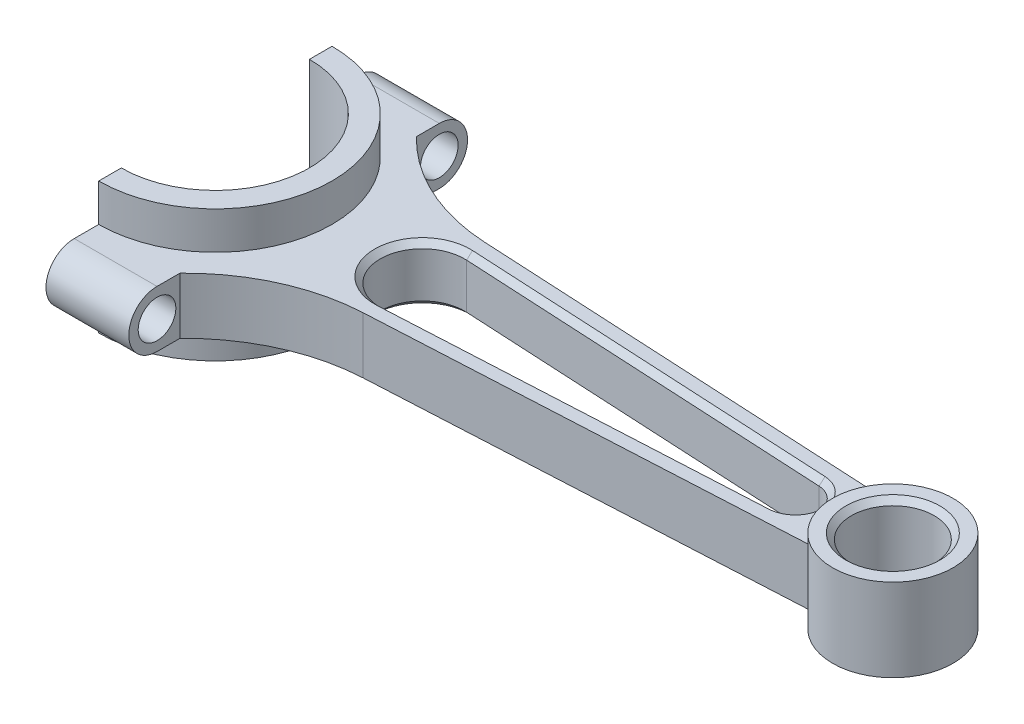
ISO-10303-21;
HEADER;
FILE_DESCRIPTION(('STEP AP214'),'2;1');
FILE_NAME('part.step','',(''),(''),'','','');
FILE_SCHEMA(('AUTOMOTIVE_DESIGN { 1 0 10303 214 1 1 1 1 }'));
ENDSEC;
DATA;
#1=APPLICATION_CONTEXT('core data for automotive mechanical design processes');
#2=APPLICATION_PROTOCOL_DEFINITION('international standard','automotive_design',2000,#1);
#3=PRODUCT_CONTEXT('',#1,'mechanical');
#4=PRODUCT('Part','Part','',(#3));
#5=PRODUCT_RELATED_PRODUCT_CATEGORY('part','',(#4));
#6=PRODUCT_DEFINITION_FORMATION('','',#4);
#7=PRODUCT_DEFINITION_CONTEXT('part definition',#1,'design');
#8=PRODUCT_DEFINITION('design','',#6,#7);
#9=PRODUCT_DEFINITION_SHAPE('','',#8);
#10=(LENGTH_UNIT() NAMED_UNIT(*) SI_UNIT(.MILLI.,.METRE.));
#11=(NAMED_UNIT(*) PLANE_ANGLE_UNIT() SI_UNIT($,.RADIAN.));
#12=(NAMED_UNIT(*) SI_UNIT($,.STERADIAN.) SOLID_ANGLE_UNIT());
#13=UNCERTAINTY_MEASURE_WITH_UNIT(LENGTH_MEASURE(1.E-05),#10,'distance_accuracy_value','');
#14=(GEOMETRIC_REPRESENTATION_CONTEXT(3) GLOBAL_UNCERTAINTY_ASSIGNED_CONTEXT((#13)) GLOBAL_UNIT_ASSIGNED_CONTEXT((#10,
#11,#12)) REPRESENTATION_CONTEXT('',''));
#15=CARTESIAN_POINT('',(0.,0.,0.));
#16=DIRECTION('',(0.,0.,1.));
#17=DIRECTION('',(1.,0.,0.));
#18=AXIS2_PLACEMENT_3D('',#15,#16,#17);
#19=CARTESIAN_POINT('',(22.,0.,-37.5));
#20=DIRECTION('',(1.,0.,0.));
#21=DIRECTION('',(0.,0.,-1.));
#22=AXIS2_PLACEMENT_3D('',#19,#20,#21);
#23=CYLINDRICAL_SURFACE('',#22,7.5);
#24=DIRECTION('',(1.,0.,0.));
#25=VECTOR('',#24,1.);
#26=CARTESIAN_POINT('',(0.,7.5,-37.5));
#27=LINE('',#26,#25);
#28=CARTESIAN_POINT('',(22.,7.5,-37.5));
#29=VERTEX_POINT('',#28);
#30=CARTESIAN_POINT('',(0.,7.5,-37.5));
#31=VERTEX_POINT('',#30);
#32=EDGE_CURVE('E344',#29,#31,#27,.F.);
#33=ORIENTED_EDGE('',*,*,#32,.F.);
#34=CARTESIAN_POINT('',(22.,0.,-37.5));
#35=DIRECTION('',(1.,0.,0.));
#36=DIRECTION('',(0.,0.,-1.));
#37=AXIS2_PLACEMENT_3D('',#34,#35,#36);
#38=CIRCLE('',#37,7.5);
#39=CARTESIAN_POINT('',(22.,-7.5,-37.5));
#40=VERTEX_POINT('',#39);
#41=EDGE_CURVE('E350',#40,#29,#38,.T.);
#42=ORIENTED_EDGE('',*,*,#41,.F.);
#43=DIRECTION('',(-1.,0.,0.));
#44=VECTOR('',#43,1.);
#45=CARTESIAN_POINT('',(22.,-7.5,-37.5));
#46=LINE('',#45,#44);
#47=CARTESIAN_POINT('',(0.,-7.5,-37.5));
#48=VERTEX_POINT('',#47);
#49=EDGE_CURVE('E347',#48,#40,#46,.F.);
#50=ORIENTED_EDGE('',*,*,#49,.F.);
#51=CARTESIAN_POINT('',(0.,0.,-37.5));
#52=DIRECTION('',(-1.,0.,0.));
#53=DIRECTION('',(0.,0.,1.));
#54=AXIS2_PLACEMENT_3D('',#51,#52,#53);
#55=CIRCLE('',#54,7.5);
#56=EDGE_CURVE('E352',#31,#48,#55,.T.);
#57=ORIENTED_EDGE('',*,*,#56,.F.);
#58=EDGE_LOOP('',(#33,#42,#50,#57));
#59=FACE_BOUND('',#58,.T.);
#60=ADVANCED_FACE('F34',(#59),#23,.T.);
#61=CARTESIAN_POINT('',(0.,0.,37.5));
#62=DIRECTION('',(1.,0.,0.));
#63=DIRECTION('',(0.,0.,-1.));
#64=AXIS2_PLACEMENT_3D('',#61,#62,#63);
#65=CYLINDRICAL_SURFACE('',#64,7.5);
#66=DIRECTION('',(-1.,0.,0.));
#67=VECTOR('',#66,1.);
#68=CARTESIAN_POINT('',(0.,7.5,37.5));
#69=LINE('',#68,#67);
#70=CARTESIAN_POINT('',(0.,7.5,37.5));
#71=VERTEX_POINT('',#70);
#72=CARTESIAN_POINT('',(22.,7.5,37.5));
#73=VERTEX_POINT('',#72);
#74=EDGE_CURVE('E324',#71,#73,#69,.F.);
#75=ORIENTED_EDGE('',*,*,#74,.F.);
#76=CARTESIAN_POINT('',(0.,0.,37.5));
#77=DIRECTION('',(-1.,0.,0.));
#78=DIRECTION('',(0.,0.,1.));
#79=AXIS2_PLACEMENT_3D('',#76,#77,#78);
#80=CIRCLE('',#79,7.5);
#81=CARTESIAN_POINT('',(0.,-7.5,37.5));
#82=VERTEX_POINT('',#81);
#83=EDGE_CURVE('E340',#82,#71,#80,.T.);
#84=ORIENTED_EDGE('',*,*,#83,.F.);
#85=DIRECTION('',(1.,0.,0.));
#86=VECTOR('',#85,1.);
#87=CARTESIAN_POINT('',(0.,-7.5,37.5));
#88=LINE('',#87,#86);
#89=CARTESIAN_POINT('',(22.,-7.5,37.5));
#90=VERTEX_POINT('',#89);
#91=EDGE_CURVE('E337',#90,#82,#88,.F.);
#92=ORIENTED_EDGE('',*,*,#91,.F.);
#93=CARTESIAN_POINT('',(22.,0.,37.5));
#94=DIRECTION('',(-1.,0.,0.));
#95=DIRECTION('',(0.,0.,1.));
#96=AXIS2_PLACEMENT_3D('',#93,#94,#95);
#97=CIRCLE('',#96,7.5);
#98=EDGE_CURVE('E342',#73,#90,#97,.F.);
#99=ORIENTED_EDGE('',*,*,#98,.F.);
#100=EDGE_LOOP('',(#75,#84,#92,#99));
#101=FACE_BOUND('',#100,.T.);
#102=ADVANCED_FACE('F469',(#101),#65,.T.);
#103=CARTESIAN_POINT('',(0.,7.5,0.));
#104=DIRECTION('',(-1.,0.,0.));
#105=DIRECTION('',(0.,0.,1.));
#106=AXIS2_PLACEMENT_3D('',#103,#104,#105);
#107=PLANE('',#106);
#108=CARTESIAN_POINT('',(0.,0.,-37.5));
#109=DIRECTION('',(1.,0.,0.));
#110=DIRECTION('',(0.,0.,-1.));
#111=AXIS2_PLACEMENT_3D('',#108,#109,#110);
#112=CIRCLE('',#111,5.00000000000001);
#113=CARTESIAN_POINT('',(0.,0.,-42.5));
#114=VERTEX_POINT('',#113);
#115=EDGE_CURVE('E627',#114,#114,#112,.T.);
#116=ORIENTED_EDGE('',*,*,#115,.T.);
#117=EDGE_LOOP('',(#116));
#118=FACE_BOUND('',#117,.T.);
#119=DIRECTION('',(0.,0.,-1.));
#120=VECTOR('',#119,1.);
#121=CARTESIAN_POINT('',(0.,7.5,0.));
#122=LINE('',#121,#120);
#123=CARTESIAN_POINT('',(0.,7.5,-31.));
#124=VERTEX_POINT('',#123);
#125=EDGE_CURVE('E254',#124,#31,#122,.T.);
#126=ORIENTED_EDGE('',*,*,#125,.T.);
#127=ORIENTED_EDGE('',*,*,#56,.T.);
#128=DIRECTION('',(0.,0.,-1.));
#129=VECTOR('',#128,1.);
#130=CARTESIAN_POINT('',(0.,-7.5,0.));
#131=LINE('',#130,#129);
#132=CARTESIAN_POINT('',(0.,-7.5,-31.));
#133=VERTEX_POINT('',#132);
#134=EDGE_CURVE('E251',#133,#48,#131,.T.);
#135=ORIENTED_EDGE('',*,*,#134,.F.);
#136=DIRECTION('',(0.,-1.,0.));
#137=VECTOR('',#136,1.);
#138=CARTESIAN_POINT('',(0.,17.5,-31.));
#139=LINE('',#138,#137);
#140=CARTESIAN_POINT('',(0.,-17.5,-31.));
#141=VERTEX_POINT('',#140);
#142=EDGE_CURVE('E242',#133,#141,#139,.T.);
#143=ORIENTED_EDGE('',*,*,#142,.T.);
#144=DIRECTION('',(0.,0.,-1.));
#145=VECTOR('',#144,1.);
#146=CARTESIAN_POINT('',(0.,-17.5,0.));
#147=LINE('',#146,#145);
#148=CARTESIAN_POINT('',(0.,-17.5,-25.));
#149=VERTEX_POINT('',#148);
#150=EDGE_CURVE('E209',#149,#141,#147,.T.);
#151=ORIENTED_EDGE('',*,*,#150,.F.);
#152=DIRECTION('',(0.,-1.,0.));
#153=VECTOR('',#152,1.);
#154=CARTESIAN_POINT('',(0.,17.5,-25.));
#155=LINE('',#154,#153);
#156=CARTESIAN_POINT('',(0.,17.5,-25.));
#157=VERTEX_POINT('',#156);
#158=EDGE_CURVE('E231',#157,#149,#155,.T.);
#159=ORIENTED_EDGE('',*,*,#158,.F.);
#160=DIRECTION('',(0.,0.,-1.));
#161=VECTOR('',#160,1.);
#162=CARTESIAN_POINT('',(0.,17.5,0.));
#163=LINE('',#162,#161);
#164=CARTESIAN_POINT('',(0.,17.5,-31.));
#165=VERTEX_POINT('',#164);
#166=EDGE_CURVE('E207',#157,#165,#163,.T.);
#167=ORIENTED_EDGE('',*,*,#166,.T.);
#168=EDGE_CURVE('E243',#165,#124,#139,.T.);
#169=ORIENTED_EDGE('',*,*,#168,.T.);
#170=EDGE_LOOP('',(#126,#127,#135,#143,#151,#159,#167,#169));
#171=FACE_BOUND('',#170,.T.);
#172=ADVANCED_FACE('F475',(#118,#171),#107,.T.);
#173=CARTESIAN_POINT('',(0.,7.5,0.));
#174=DIRECTION('',(-1.,0.,0.));
#175=DIRECTION('',(0.,0.,1.));
#176=AXIS2_PLACEMENT_3D('',#173,#174,#175);
#177=PLANE('',#176);
#178=CARTESIAN_POINT('',(0.,0.,37.5));
#179=DIRECTION('',(1.,0.,0.));
#180=DIRECTION('',(0.,0.,-1.));
#181=AXIS2_PLACEMENT_3D('',#178,#179,#180);
#182=CIRCLE('',#181,5.00000000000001);
#183=CARTESIAN_POINT('',(0.,0.,32.5));
#184=VERTEX_POINT('',#183);
#185=EDGE_CURVE('E234',#184,#184,#182,.T.);
#186=ORIENTED_EDGE('',*,*,#185,.T.);
#187=EDGE_LOOP('',(#186));
#188=FACE_BOUND('',#187,.T.);
#189=DIRECTION('',(0.,0.,-1.));
#190=VECTOR('',#189,1.);
#191=CARTESIAN_POINT('',(0.,-7.5,0.));
#192=LINE('',#191,#190);
#193=CARTESIAN_POINT('',(0.,-7.5,31.));
#194=VERTEX_POINT('',#193);
#195=EDGE_CURVE('E287',#82,#194,#192,.T.);
#196=ORIENTED_EDGE('',*,*,#195,.F.);
#197=ORIENTED_EDGE('',*,*,#83,.T.);
#198=DIRECTION('',(0.,0.,-1.));
#199=VECTOR('',#198,1.);
#200=CARTESIAN_POINT('',(0.,7.5,0.));
#201=LINE('',#200,#199);
#202=CARTESIAN_POINT('',(0.,7.5,31.));
#203=VERTEX_POINT('',#202);
#204=EDGE_CURVE('E261',#71,#203,#201,.T.);
#205=ORIENTED_EDGE('',*,*,#204,.T.);
#206=DIRECTION('',(0.,-1.,0.));
#207=VECTOR('',#206,1.);
#208=CARTESIAN_POINT('',(0.,17.5,31.));
#209=LINE('',#208,#207);
#210=CARTESIAN_POINT('',(0.,17.5,31.));
#211=VERTEX_POINT('',#210);
#212=EDGE_CURVE('E220',#211,#203,#209,.T.);
#213=ORIENTED_EDGE('',*,*,#212,.F.);
#214=DIRECTION('',(0.,0.,-1.));
#215=VECTOR('',#214,1.);
#216=CARTESIAN_POINT('',(0.,17.5,0.));
#217=LINE('',#216,#215);
#218=CARTESIAN_POINT('',(0.,17.5,25.));
#219=VERTEX_POINT('',#218);
#220=EDGE_CURVE('E204',#211,#219,#217,.T.);
#221=ORIENTED_EDGE('',*,*,#220,.T.);
#222=DIRECTION('',(0.,-1.,0.));
#223=VECTOR('',#222,1.);
#224=CARTESIAN_POINT('',(0.,17.5,25.));
#225=LINE('',#224,#223);
#226=CARTESIAN_POINT('',(0.,-17.5,25.));
#227=VERTEX_POINT('',#226);
#228=EDGE_CURVE('E212',#219,#227,#225,.T.);
#229=ORIENTED_EDGE('',*,*,#228,.T.);
#230=DIRECTION('',(0.,0.,-1.));
#231=VECTOR('',#230,1.);
#232=CARTESIAN_POINT('',(0.,-17.5,0.));
#233=LINE('',#232,#231);
#234=CARTESIAN_POINT('',(0.,-17.5,31.));
#235=VERTEX_POINT('',#234);
#236=EDGE_CURVE('E233',#235,#227,#233,.T.);
#237=ORIENTED_EDGE('',*,*,#236,.F.);
#238=EDGE_CURVE('E246',#194,#235,#209,.T.);
#239=ORIENTED_EDGE('',*,*,#238,.F.);
#240=EDGE_LOOP('',(#196,#197,#205,#213,#221,#229,#237,#239));
#241=FACE_BOUND('',#240,.T.);
#242=ADVANCED_FACE('F223',(#188,#241),#177,.T.);
#243=CARTESIAN_POINT('',(22.,7.5,0.));
#244=DIRECTION('',(-1.,0.,0.));
#245=DIRECTION('',(0.,0.,1.));
#246=AXIS2_PLACEMENT_3D('',#243,#244,#245);
#247=PLANE('',#246);
#248=CARTESIAN_POINT('',(22.,0.,37.5));
#249=DIRECTION('',(1.,0.,0.));
#250=DIRECTION('',(0.,0.,-1.));
#251=AXIS2_PLACEMENT_3D('',#248,#249,#250);
#252=CIRCLE('',#251,5.00000000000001);
#253=CARTESIAN_POINT('',(22.,0.,32.5));
#254=VERTEX_POINT('',#253);
#255=EDGE_CURVE('E630',#254,#254,#252,.T.);
#256=ORIENTED_EDGE('',*,*,#255,.F.);
#257=EDGE_LOOP('',(#256));
#258=FACE_BOUND('',#257,.T.);
#259=DIRECTION('',(0.,0.,-1.));
#260=VECTOR('',#259,1.);
#261=CARTESIAN_POINT('',(22.,7.5,0.));
#262=LINE('',#261,#260);
#263=CARTESIAN_POINT('',(22.,7.5,31.421296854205));
#264=VERTEX_POINT('',#263);
#265=EDGE_CURVE('E263',#73,#264,#262,.T.);
#266=ORIENTED_EDGE('',*,*,#265,.F.);
#267=ORIENTED_EDGE('',*,*,#98,.T.);
#268=DIRECTION('',(0.,0.,-1.));
#269=VECTOR('',#268,1.);
#270=CARTESIAN_POINT('',(22.,-7.5,0.));
#271=LINE('',#270,#269);
#272=CARTESIAN_POINT('',(22.,-7.5,31.421296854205));
#273=VERTEX_POINT('',#272);
#274=EDGE_CURVE('E289',#90,#273,#271,.T.);
#275=ORIENTED_EDGE('',*,*,#274,.T.);
#276=DIRECTION('',(0.,-1.,0.));
#277=VECTOR('',#276,1.);
#278=CARTESIAN_POINT('',(22.,7.5,31.421296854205));
#279=LINE('',#278,#277);
#280=EDGE_CURVE('E321',#264,#273,#279,.T.);
#281=ORIENTED_EDGE('',*,*,#280,.F.);
#282=EDGE_LOOP('',(#266,#267,#275,#281));
#283=FACE_BOUND('',#282,.T.);
#284=ADVANCED_FACE('F544',(#258,#283),#247,.F.);
#285=CARTESIAN_POINT('',(58.,7.5,66.12));
#286=DIRECTION('',(0.,-1.,0.));
#287=DIRECTION('',(0.,0.,-1.));
#288=AXIS2_PLACEMENT_3D('',#285,#286,#287);
#289=CYLINDRICAL_SURFACE('',#288,50.);
#290=CARTESIAN_POINT('',(58.,-7.5,66.12));
#291=DIRECTION('',(0.,1.,0.));
#292=DIRECTION('',(0.,0.,1.));
#293=AXIS2_PLACEMENT_3D('',#290,#291,#292);
#294=CIRCLE('',#293,50.);
#295=CARTESIAN_POINT('',(55.3832021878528,-7.5,16.1885232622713));
#296=VERTEX_POINT('',#295);
#297=EDGE_CURVE('E291',#273,#296,#294,.F.);
#298=ORIENTED_EDGE('',*,*,#297,.T.);
#299=DIRECTION('',(0.,-1.,0.));
#300=VECTOR('',#299,1.);
#301=CARTESIAN_POINT('',(55.3832021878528,7.5,16.1885232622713));
#302=LINE('',#301,#300);
#303=CARTESIAN_POINT('',(55.3832021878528,7.5,16.1885232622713));
#304=VERTEX_POINT('',#303);
#305=EDGE_CURVE('E318',#304,#296,#302,.T.);
#306=ORIENTED_EDGE('',*,*,#305,.F.);
#307=CARTESIAN_POINT('',(58.,7.5,66.12));
#308=DIRECTION('',(0.,1.,0.));
#309=DIRECTION('',(0.,0.,1.));
#310=AXIS2_PLACEMENT_3D('',#307,#308,#309);
#311=CIRCLE('',#310,50.);
#312=EDGE_CURVE('E265',#264,#304,#311,.F.);
#313=ORIENTED_EDGE('',*,*,#312,.F.);
#314=ORIENTED_EDGE('',*,*,#280,.T.);
#315=EDGE_LOOP('',(#298,#306,#313,#314));
#316=FACE_BOUND('',#315,.T.);
#317=ADVANCED_FACE('F546',(#316),#289,.F.);
#318=CARTESIAN_POINT('',(0.997778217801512,7.5,19.0387425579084));
#319=DIRECTION('',(-0.0523359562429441,0.,-0.998629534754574));
#320=DIRECTION('',(-0.998629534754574,0.,0.0523359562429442));
#321=AXIS2_PLACEMENT_3D('',#318,#319,#320);
#322=PLANE('',#321);
#323=DIRECTION('',(0.998629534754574,0.,-0.0523359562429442));
#324=VECTOR('',#323,1.);
#325=CARTESIAN_POINT('',(0.997778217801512,-7.5,19.0387425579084));
#326=LINE('',#325,#324);
#327=CARTESIAN_POINT('',(167.75566421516,-7.5,10.2993320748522));
#328=VERTEX_POINT('',#327);
#329=EDGE_CURVE('E294',#296,#328,#326,.T.);
#330=ORIENTED_EDGE('',*,*,#329,.T.);
#331=DIRECTION('',(0.,-1.,0.));
#332=VECTOR('',#331,1.);
#333=CARTESIAN_POINT('',(167.75566421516,7.5,10.2993320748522));
#334=LINE('',#333,#332);
#335=CARTESIAN_POINT('',(167.75566421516,7.5,10.2993320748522));
#336=VERTEX_POINT('',#335);
#337=EDGE_CURVE('E316',#336,#328,#334,.T.);
#338=ORIENTED_EDGE('',*,*,#337,.F.);
#339=DIRECTION('',(0.998629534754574,0.,-0.0523359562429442));
#340=VECTOR('',#339,1.);
#341=CARTESIAN_POINT('',(0.997778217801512,7.5,19.0387425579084));
#342=LINE('',#341,#340);
#343=EDGE_CURVE('E268',#304,#336,#342,.T.);
#344=ORIENTED_EDGE('',*,*,#343,.F.);
#345=ORIENTED_EDGE('',*,*,#305,.T.);
#346=EDGE_LOOP('',(#330,#338,#344,#345));
#347=FACE_BOUND('',#346,.T.);
#348=ADVANCED_FACE('F551',(#347),#322,.F.);
#349=CARTESIAN_POINT('',(0.997778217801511,7.5,-19.0387425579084));
#350=DIRECTION('',(0.052335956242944,0.,-0.998629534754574));
#351=DIRECTION('',(-0.998629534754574,0.,-0.052335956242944));
#352=AXIS2_PLACEMENT_3D('',#349,#350,#351);
#353=PLANE('',#352);
#354=DIRECTION('',(0.998629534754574,0.,0.052335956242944));
#355=VECTOR('',#354,1.);
#356=CARTESIAN_POINT('',(0.997778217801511,-7.5,-19.0387425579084));
#357=LINE('',#356,#355);
#358=CARTESIAN_POINT('',(55.3832021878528,-7.5,-16.1885232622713));
#359=VERTEX_POINT('',#358);
#360=CARTESIAN_POINT('',(167.75566421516,-7.5,-10.2993320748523));
#361=VERTEX_POINT('',#360);
#362=EDGE_CURVE('E300',#359,#361,#357,.T.);
#363=ORIENTED_EDGE('',*,*,#362,.F.);
#364=DIRECTION('',(0.,-1.,0.));
#365=VECTOR('',#364,1.);
#366=CARTESIAN_POINT('',(55.3832021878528,7.5,-16.1885232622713));
#367=LINE('',#366,#365);
#368=CARTESIAN_POINT('',(55.3832021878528,7.5,-16.1885232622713));
#369=VERTEX_POINT('',#368);
#370=EDGE_CURVE('E310',#369,#359,#367,.T.);
#371=ORIENTED_EDGE('',*,*,#370,.F.);
#372=DIRECTION('',(0.998629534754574,0.,0.052335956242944));
#373=VECTOR('',#372,1.);
#374=CARTESIAN_POINT('',(0.997778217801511,7.5,-19.0387425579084));
#375=LINE('',#374,#373);
#376=CARTESIAN_POINT('',(167.75566421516,7.5,-10.2993320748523));
#377=VERTEX_POINT('',#376);
#378=EDGE_CURVE('E273',#369,#377,#375,.T.);
#379=ORIENTED_EDGE('',*,*,#378,.T.);
#380=DIRECTION('',(0.,-1.,0.));
#381=VECTOR('',#380,1.);
#382=CARTESIAN_POINT('',(167.75566421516,7.5,-10.2993320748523));
#383=LINE('',#382,#381);
#384=EDGE_CURVE('E313',#377,#361,#383,.T.);
#385=ORIENTED_EDGE('',*,*,#384,.T.);
#386=EDGE_LOOP('',(#363,#371,#379,#385));
#387=FACE_BOUND('',#386,.T.);
#388=ADVANCED_FACE('F556',(#387),#353,.T.);
#389=CARTESIAN_POINT('',(58.,7.5,-66.12));
#390=DIRECTION('',(0.,-1.,0.));
#391=DIRECTION('',(0.,0.,-1.));
#392=AXIS2_PLACEMENT_3D('',#389,#390,#391);
#393=CYLINDRICAL_SURFACE('',#392,50.);
#394=CARTESIAN_POINT('',(58.,-7.5,-66.12));
#395=DIRECTION('',(0.,1.,0.));
#396=DIRECTION('',(0.,0.,1.));
#397=AXIS2_PLACEMENT_3D('',#394,#395,#396);
#398=CIRCLE('',#397,50.);
#399=CARTESIAN_POINT('',(22.,-7.5,-31.421296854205));
#400=VERTEX_POINT('',#399);
#401=EDGE_CURVE('E303',#400,#359,#398,.T.);
#402=ORIENTED_EDGE('',*,*,#401,.F.);
#403=DIRECTION('',(0.,-1.,0.));
#404=VECTOR('',#403,1.);
#405=CARTESIAN_POINT('',(22.,7.5,-31.421296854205));
#406=LINE('',#405,#404);
#407=CARTESIAN_POINT('',(22.,7.5,-31.421296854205));
#408=VERTEX_POINT('',#407);
#409=EDGE_CURVE('E307',#408,#400,#406,.T.);
#410=ORIENTED_EDGE('',*,*,#409,.F.);
#411=CARTESIAN_POINT('',(58.,7.5,-66.12));
#412=DIRECTION('',(0.,1.,0.));
#413=DIRECTION('',(0.,0.,1.));
#414=AXIS2_PLACEMENT_3D('',#411,#412,#413);
#415=CIRCLE('',#414,50.);
#416=EDGE_CURVE('E276',#408,#369,#415,.T.);
#417=ORIENTED_EDGE('',*,*,#416,.T.);
#418=ORIENTED_EDGE('',*,*,#370,.T.);
#419=EDGE_LOOP('',(#402,#410,#417,#418));
#420=FACE_BOUND('',#419,.T.);
#421=ADVANCED_FACE('F519',(#420),#393,.F.);
#422=CARTESIAN_POINT('',(22.,7.5,0.));
#423=DIRECTION('',(1.,0.,0.));
#424=DIRECTION('',(0.,0.,-1.));
#425=AXIS2_PLACEMENT_3D('',#422,#423,#424);
#426=PLANE('',#425);
#427=CARTESIAN_POINT('',(22.,0.,-37.5));
#428=DIRECTION('',(1.,0.,0.));
#429=DIRECTION('',(0.,0.,-1.));
#430=AXIS2_PLACEMENT_3D('',#427,#428,#429);
#431=CIRCLE('',#430,5.00000000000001);
#432=CARTESIAN_POINT('',(22.,0.,-42.5));
#433=VERTEX_POINT('',#432);
#434=EDGE_CURVE('E408',#433,#433,#431,.T.);
#435=ORIENTED_EDGE('',*,*,#434,.F.);
#436=EDGE_LOOP('',(#435));
#437=FACE_BOUND('',#436,.T.);
#438=DIRECTION('',(0.,0.,1.));
#439=VECTOR('',#438,1.);
#440=CARTESIAN_POINT('',(22.,-7.5,0.));
#441=LINE('',#440,#439);
#442=EDGE_CURVE('E258',#40,#400,#441,.T.);
#443=ORIENTED_EDGE('',*,*,#442,.F.);
#444=ORIENTED_EDGE('',*,*,#41,.T.);
#445=DIRECTION('',(0.,0.,1.));
#446=VECTOR('',#445,1.);
#447=CARTESIAN_POINT('',(22.,7.5,0.));
#448=LINE('',#447,#446);
#449=EDGE_CURVE('E279',#29,#408,#448,.T.);
#450=ORIENTED_EDGE('',*,*,#449,.T.);
#451=ORIENTED_EDGE('',*,*,#409,.T.);
#452=EDGE_LOOP('',(#443,#444,#450,#451));
#453=FACE_BOUND('',#452,.T.);
#454=ADVANCED_FACE('F516',(#437,#453),#426,.T.);
#455=CARTESIAN_POINT('',(55.,7.5,0.));
#456=DIRECTION('',(0.,-1.,0.));
#457=DIRECTION('',(0.,0.,-1.));
#458=AXIS2_PLACEMENT_3D('',#455,#456,#457);
#459=CYLINDRICAL_SURFACE('',#458,11.1863927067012);
#460=DIRECTION('',(0.,-1.,0.));
#461=VECTOR('',#460,1.);
#462=CARTESIAN_POINT('',(55.5854505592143,7.5,11.171062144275));
#463=LINE('',#462,#461);
#464=CARTESIAN_POINT('',(55.5854505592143,5.99999999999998,11.171062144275));
#465=VERTEX_POINT('',#464);
#466=CARTESIAN_POINT('',(55.5854505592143,-5.99999999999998,11.171062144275));
#467=VERTEX_POINT('',#466);
#468=EDGE_CURVE('E281',#465,#467,#463,.T.);
#469=ORIENTED_EDGE('',*,*,#468,.T.);
#470=CARTESIAN_POINT('',(55.,-5.99999999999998,0.));
#471=DIRECTION('',(0.,1.,0.));
#472=DIRECTION('',(0.,0.,1.));
#473=AXIS2_PLACEMENT_3D('',#470,#471,#472);
#474=CIRCLE('',#473,11.1863927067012);
#475=CARTESIAN_POINT('',(55.5854505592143,-5.99999999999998,-11.171062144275));
#476=VERTEX_POINT('',#475);
#477=EDGE_CURVE('E391',#467,#476,#474,.F.);
#478=ORIENTED_EDGE('',*,*,#477,.T.);
#479=DIRECTION('',(0.,-1.,0.));
#480=VECTOR('',#479,1.);
#481=CARTESIAN_POINT('',(55.5854505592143,7.5,-11.171062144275));
#482=LINE('',#481,#480);
#483=CARTESIAN_POINT('',(55.5854505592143,5.99999999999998,-11.171062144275));
#484=VERTEX_POINT('',#483);
#485=EDGE_CURVE('E311',#484,#476,#482,.T.);
#486=ORIENTED_EDGE('',*,*,#485,.F.);
#487=CARTESIAN_POINT('',(55.,5.99999999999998,0.));
#488=DIRECTION('',(0.,1.,0.));
#489=DIRECTION('',(0.,0.,1.));
#490=AXIS2_PLACEMENT_3D('',#487,#488,#489);
#491=CIRCLE('',#490,11.1863927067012);
#492=EDGE_CURVE('E389',#484,#465,#491,.T.);
#493=ORIENTED_EDGE('',*,*,#492,.T.);
#494=EDGE_LOOP('',(#469,#478,#486,#493));
#495=FACE_BOUND('',#494,.T.);
#496=ADVANCED_FACE('F427',(#495),#459,.F.);
#497=CARTESIAN_POINT('',(0.736098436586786,7.5,-14.0455948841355));
#498=DIRECTION('',(0.0523359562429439,0.,-0.998629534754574));
#499=DIRECTION('',(-0.998629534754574,0.,-0.0523359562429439));
#500=AXIS2_PLACEMENT_3D('',#497,#498,#499);
#501=PLANE('',#500);
#502=ORIENTED_EDGE('',*,*,#485,.T.);
#503=DIRECTION('',(0.998629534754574,0.,0.0523359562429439));
#504=VECTOR('',#503,1.);
#505=CARTESIAN_POINT('',(0.736098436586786,-5.99999999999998,-14.0455948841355));
#506=LINE('',#505,#504);
#507=CARTESIAN_POINT('',(154.412094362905,-5.99999999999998,-5.99177720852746));
#508=VERTEX_POINT('',#507);
#509=EDGE_CURVE('E383',#476,#508,#506,.T.);
#510=ORIENTED_EDGE('',*,*,#509,.T.);
#511=DIRECTION('',(0.,-1.,0.));
#512=VECTOR('',#511,1.);
#513=CARTESIAN_POINT('',(154.412094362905,7.5,-5.99177720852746));
#514=LINE('',#513,#512);
#515=CARTESIAN_POINT('',(154.412094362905,5.99999999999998,-5.99177720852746));
#516=VERTEX_POINT('',#515);
#517=EDGE_CURVE('E330',#516,#508,#514,.T.);
#518=ORIENTED_EDGE('',*,*,#517,.F.);
#519=DIRECTION('',(-0.998629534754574,0.,-0.0523359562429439));
#520=VECTOR('',#519,1.);
#521=CARTESIAN_POINT('',(55.5854505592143,5.99999999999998,-11.171062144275));
#522=LINE('',#521,#520);
#523=EDGE_CURVE('E381',#516,#484,#522,.T.);
#524=ORIENTED_EDGE('',*,*,#523,.T.);
#525=EDGE_LOOP('',(#502,#510,#518,#524));
#526=FACE_BOUND('',#525,.T.);
#527=ADVANCED_FACE('F456',(#526),#501,.F.);
#528=CARTESIAN_POINT('',(154.098078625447,7.5,0.));
#529=DIRECTION('',(0.,-1.,0.));
#530=DIRECTION('',(0.,0.,-1.));
#531=AXIS2_PLACEMENT_3D('',#528,#529,#530);
#532=CYLINDRICAL_SURFACE('',#531,6.);
#533=ORIENTED_EDGE('',*,*,#517,.T.);
#534=CARTESIAN_POINT('',(154.098078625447,-5.99999999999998,0.));
#535=DIRECTION('',(0.,1.,0.));
#536=DIRECTION('',(0.,0.,1.));
#537=AXIS2_PLACEMENT_3D('',#534,#535,#536);
#538=CIRCLE('',#537,6.);
#539=CARTESIAN_POINT('',(154.412094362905,-5.99999999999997,5.99177720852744));
#540=VERTEX_POINT('',#539);
#541=EDGE_CURVE('E369',#508,#540,#538,.F.);
#542=ORIENTED_EDGE('',*,*,#541,.T.);
#543=DIRECTION('',(0.,-1.,0.));
#544=VECTOR('',#543,1.);
#545=CARTESIAN_POINT('',(154.412094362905,7.5,5.99177720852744));
#546=LINE('',#545,#544);
#547=CARTESIAN_POINT('',(154.412094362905,5.99999999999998,5.99177720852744));
#548=VERTEX_POINT('',#547);
#549=EDGE_CURVE('E327',#548,#540,#546,.T.);
#550=ORIENTED_EDGE('',*,*,#549,.F.);
#551=CARTESIAN_POINT('',(154.098078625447,5.99999999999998,0.));
#552=DIRECTION('',(0.,1.,0.));
#553=DIRECTION('',(0.,0.,1.));
#554=AXIS2_PLACEMENT_3D('',#551,#552,#553);
#555=CIRCLE('',#554,6.);
#556=EDGE_CURVE('E366',#548,#516,#555,.T.);
#557=ORIENTED_EDGE('',*,*,#556,.T.);
#558=EDGE_LOOP('',(#533,#542,#550,#557));
#559=FACE_BOUND('',#558,.T.);
#560=ADVANCED_FACE('F440',(#559),#532,.F.);
#561=CARTESIAN_POINT('',(0.736098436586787,7.5,14.0455948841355));
#562=DIRECTION('',(0.052335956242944,0.,0.998629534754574));
#563=DIRECTION('',(0.998629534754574,0.,-0.052335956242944));
#564=AXIS2_PLACEMENT_3D('',#561,#562,#563);
#565=PLANE('',#564);
#566=ORIENTED_EDGE('',*,*,#549,.T.);
#567=DIRECTION('',(-0.998629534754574,0.,0.052335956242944));
#568=VECTOR('',#567,1.);
#569=CARTESIAN_POINT('',(0.736098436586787,-5.99999999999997,14.0455948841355));
#570=LINE('',#569,#568);
#571=EDGE_CURVE('E387',#540,#467,#570,.T.);
#572=ORIENTED_EDGE('',*,*,#571,.T.);
#573=ORIENTED_EDGE('',*,*,#468,.F.);
#574=DIRECTION('',(0.998629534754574,0.,-0.052335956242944));
#575=VECTOR('',#574,1.);
#576=CARTESIAN_POINT('',(154.412094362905,5.99999999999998,5.99177720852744));
#577=LINE('',#576,#575);
#578=EDGE_CURVE('E385',#465,#548,#577,.T.);
#579=ORIENTED_EDGE('',*,*,#578,.T.);
#580=EDGE_LOOP('',(#566,#572,#573,#579));
#581=FACE_BOUND('',#580,.T.);
#582=ADVANCED_FACE('F430',(#581),#565,.F.);
#583=CARTESIAN_POINT('',(0.,7.5,0.));
#584=DIRECTION('',(0.,1.,0.));
#585=DIRECTION('',(0.,0.,1.));
#586=AXIS2_PLACEMENT_3D('',#583,#584,#585);
#587=PLANE('',#586);
#588=DIRECTION('',(0.998629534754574,0.,0.0523359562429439));
#589=VECTOR('',#588,1.);
#590=CARTESIAN_POINT('',(154.49059829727,7.5,-7.48972151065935));
#591=LINE('',#590,#589);
#592=CARTESIAN_POINT('',(55.6639544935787,7.5,-12.6690064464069));
#593=VERTEX_POINT('',#592);
#594=CARTESIAN_POINT('',(154.49059829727,7.5,-7.48972151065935));
#595=VERTEX_POINT('',#594);
#596=EDGE_CURVE('E43',#593,#595,#591,.T.);
#597=ORIENTED_EDGE('',*,*,#596,.T.);
#598=CARTESIAN_POINT('',(154.098078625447,7.5,0.));
#599=DIRECTION('',(0.,1.,0.));
#600=DIRECTION('',(0.,0.,1.));
#601=AXIS2_PLACEMENT_3D('',#598,#599,#600);
#602=CIRCLE('',#601,7.50000000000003);
#603=CARTESIAN_POINT('',(154.49059829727,7.5,7.48972151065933));
#604=VERTEX_POINT('',#603);
#605=EDGE_CURVE('E11',#595,#604,#602,.F.);
#606=ORIENTED_EDGE('',*,*,#605,.T.);
#607=DIRECTION('',(-0.998629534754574,0.,0.052335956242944));
#608=VECTOR('',#607,1.);
#609=CARTESIAN_POINT('',(55.6639544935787,7.5,12.6690064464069));
#610=LINE('',#609,#608);
#611=CARTESIAN_POINT('',(55.6639544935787,7.5,12.6690064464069));
#612=VERTEX_POINT('',#611);
#613=EDGE_CURVE('E395',#604,#612,#610,.T.);
#614=ORIENTED_EDGE('',*,*,#613,.T.);
#615=CARTESIAN_POINT('',(55.,7.5,0.));
#616=DIRECTION('',(0.,1.,0.));
#617=DIRECTION('',(0.,0.,1.));
#618=AXIS2_PLACEMENT_3D('',#615,#616,#617);
#619=CIRCLE('',#618,12.6863927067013);
#620=EDGE_CURVE('E393',#612,#593,#619,.F.);
#621=ORIENTED_EDGE('',*,*,#620,.T.);
#622=EDGE_LOOP('',(#597,#606,#614,#621));
#623=FACE_BOUND('',#622,.T.);
#624=ORIENTED_EDGE('',*,*,#449,.F.);
#625=ORIENTED_EDGE('',*,*,#32,.T.);
#626=ORIENTED_EDGE('',*,*,#125,.F.);
#627=CARTESIAN_POINT('',(0.,7.5,0.));
#628=DIRECTION('',(0.,1.,0.));
#629=DIRECTION('',(0.,0.,1.));
#630=AXIS2_PLACEMENT_3D('',#627,#628,#629);
#631=CIRCLE('',#630,31.);
#632=EDGE_CURVE('E257',#124,#203,#631,.F.);
#633=ORIENTED_EDGE('',*,*,#632,.T.);
#634=ORIENTED_EDGE('',*,*,#204,.F.);
#635=ORIENTED_EDGE('',*,*,#74,.T.);
#636=ORIENTED_EDGE('',*,*,#265,.T.);
#637=ORIENTED_EDGE('',*,*,#312,.T.);
#638=ORIENTED_EDGE('',*,*,#343,.T.);
#639=CARTESIAN_POINT('',(180.,7.5,0.));
#640=DIRECTION('',(0.,1.,0.));
#641=DIRECTION('',(0.,0.,1.));
#642=AXIS2_PLACEMENT_3D('',#639,#640,#641);
#643=CIRCLE('',#642,16.);
#644=EDGE_CURVE('E271',#377,#336,#643,.T.);
#645=ORIENTED_EDGE('',*,*,#644,.F.);
#646=ORIENTED_EDGE('',*,*,#378,.F.);
#647=ORIENTED_EDGE('',*,*,#416,.F.);
#648=EDGE_LOOP('',(#624,#625,#626,#633,#634,#635,#636,#637,#638,#645,#646,#647));
#649=FACE_BOUND('',#648,.T.);
#650=ADVANCED_FACE('F506',(#623,#649),#587,.T.);
#651=CARTESIAN_POINT('',(0.,-7.5,0.));
#652=DIRECTION('',(0.,1.,0.));
#653=DIRECTION('',(0.,0.,1.));
#654=AXIS2_PLACEMENT_3D('',#651,#652,#653);
#655=PLANE('',#654);
#656=DIRECTION('',(0.998629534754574,0.,-0.052335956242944));
#657=VECTOR('',#656,1.);
#658=CARTESIAN_POINT('',(0.814602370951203,-7.5,15.5435391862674));
#659=LINE('',#658,#657);
#660=CARTESIAN_POINT('',(55.6639544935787,-7.5,12.6690064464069));
#661=VERTEX_POINT('',#660);
#662=CARTESIAN_POINT('',(154.49059829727,-7.5,7.48972151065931));
#663=VERTEX_POINT('',#662);
#664=EDGE_CURVE('E374',#661,#663,#659,.T.);
#665=ORIENTED_EDGE('',*,*,#664,.T.);
#666=CARTESIAN_POINT('',(154.098078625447,-7.5,0.));
#667=DIRECTION('',(0.,1.,0.));
#668=DIRECTION('',(0.,0.,1.));
#669=AXIS2_PLACEMENT_3D('',#666,#667,#668);
#670=CIRCLE('',#669,7.5);
#671=CARTESIAN_POINT('',(154.49059829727,-7.5,-7.48972151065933));
#672=VERTEX_POINT('',#671);
#673=EDGE_CURVE('E378',#663,#672,#670,.T.);
#674=ORIENTED_EDGE('',*,*,#673,.T.);
#675=DIRECTION('',(-0.998629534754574,0.,-0.0523359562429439));
#676=VECTOR('',#675,1.);
#677=CARTESIAN_POINT('',(0.814602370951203,-7.5,-15.5435391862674));
#678=LINE('',#677,#676);
#679=CARTESIAN_POINT('',(55.6639544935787,-7.5,-12.6690064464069));
#680=VERTEX_POINT('',#679);
#681=EDGE_CURVE('E376',#672,#680,#678,.T.);
#682=ORIENTED_EDGE('',*,*,#681,.T.);
#683=CARTESIAN_POINT('',(55.,-7.5,0.));
#684=DIRECTION('',(0.,1.,0.));
#685=DIRECTION('',(0.,0.,1.));
#686=AXIS2_PLACEMENT_3D('',#683,#684,#685);
#687=CIRCLE('',#686,12.6863927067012);
#688=EDGE_CURVE('E372',#680,#661,#687,.T.);
#689=ORIENTED_EDGE('',*,*,#688,.T.);
#690=EDGE_LOOP('',(#665,#674,#682,#689));
#691=FACE_BOUND('',#690,.T.);
#692=ORIENTED_EDGE('',*,*,#134,.T.);
#693=ORIENTED_EDGE('',*,*,#49,.T.);
#694=ORIENTED_EDGE('',*,*,#442,.T.);
#695=ORIENTED_EDGE('',*,*,#401,.T.);
#696=ORIENTED_EDGE('',*,*,#362,.T.);
#697=CARTESIAN_POINT('',(180.,-7.5,0.));
#698=DIRECTION('',(0.,1.,0.));
#699=DIRECTION('',(0.,0.,1.));
#700=AXIS2_PLACEMENT_3D('',#697,#698,#699);
#701=CIRCLE('',#700,16.);
#702=EDGE_CURVE('E297',#361,#328,#701,.T.);
#703=ORIENTED_EDGE('',*,*,#702,.T.);
#704=ORIENTED_EDGE('',*,*,#329,.F.);
#705=ORIENTED_EDGE('',*,*,#297,.F.);
#706=ORIENTED_EDGE('',*,*,#274,.F.);
#707=ORIENTED_EDGE('',*,*,#91,.T.);
#708=ORIENTED_EDGE('',*,*,#195,.T.);
#709=CARTESIAN_POINT('',(0.,-7.5,0.));
#710=DIRECTION('',(0.,1.,0.));
#711=DIRECTION('',(0.,0.,1.));
#712=AXIS2_PLACEMENT_3D('',#709,#710,#711);
#713=CIRCLE('',#712,31.);
#714=EDGE_CURVE('E284',#133,#194,#713,.F.);
#715=ORIENTED_EDGE('',*,*,#714,.F.);
#716=EDGE_LOOP('',(#692,#693,#694,#695,#696,#703,#704,#705,#706,#707,#708,#715));
#717=FACE_BOUND('',#716,.T.);
#718=ADVANCED_FACE('F448',(#691,#717),#655,.F.);
#719=CARTESIAN_POINT('',(180.,11.,0.));
#720=DIRECTION('',(0.,-1.,0.));
#721=DIRECTION('',(0.,0.,-1.));
#722=AXIS2_PLACEMENT_3D('',#719,#720,#721);
#723=CYLINDRICAL_SURFACE('',#722,11.);
#724=CARTESIAN_POINT('',(180.,-9.50000000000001,0.));
#725=DIRECTION('',(0.,1.,0.));
#726=DIRECTION('',(0.,0.,1.));
#727=AXIS2_PLACEMENT_3D('',#724,#725,#726);
#728=CIRCLE('',#727,11.);
#729=CARTESIAN_POINT('',(180.,-9.50000000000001,11.));
#730=VERTEX_POINT('',#729);
#731=EDGE_CURVE('E360',#730,#730,#728,.F.);
#732=ORIENTED_EDGE('',*,*,#731,.T.);
#733=EDGE_LOOP('',(#732));
#734=FACE_BOUND('',#733,.T.);
#735=CARTESIAN_POINT('',(180.,9.49999999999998,0.));
#736=DIRECTION('',(0.,1.,0.));
#737=DIRECTION('',(0.,0.,1.));
#738=AXIS2_PLACEMENT_3D('',#735,#736,#737);
#739=CIRCLE('',#738,11.);
#740=CARTESIAN_POINT('',(180.,9.49999999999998,11.));
#741=VERTEX_POINT('',#740);
#742=EDGE_CURVE('E357',#741,#741,#739,.T.);
#743=ORIENTED_EDGE('',*,*,#742,.T.);
#744=EDGE_LOOP('',(#743));
#745=FACE_BOUND('',#744,.T.);
#746=ADVANCED_FACE('F593',(#734,#745),#723,.F.);
#747=CARTESIAN_POINT('',(180.,11.,0.));
#748=DIRECTION('',(0.,-1.,0.));
#749=DIRECTION('',(0.,0.,-1.));
#750=AXIS2_PLACEMENT_3D('',#747,#748,#749);
#751=CYLINDRICAL_SURFACE('',#750,16.);
#752=ORIENTED_EDGE('',*,*,#644,.T.);
#753=ORIENTED_EDGE('',*,*,#337,.T.);
#754=ORIENTED_EDGE('',*,*,#702,.F.);
#755=ORIENTED_EDGE('',*,*,#384,.F.);
#756=EDGE_LOOP('',(#752,#753,#754,#755));
#757=FACE_BOUND('',#756,.T.);
#758=CARTESIAN_POINT('',(180.,11.,0.));
#759=DIRECTION('',(0.,1.,0.));
#760=DIRECTION('',(0.,0.,1.));
#761=AXIS2_PLACEMENT_3D('',#758,#759,#760);
#762=CIRCLE('',#761,16.);
#763=CARTESIAN_POINT('',(180.,11.,16.));
#764=VERTEX_POINT('',#763);
#765=EDGE_CURVE('E248',#764,#764,#762,.T.);
#766=ORIENTED_EDGE('',*,*,#765,.F.);
#767=EDGE_LOOP('',(#766));
#768=FACE_BOUND('',#767,.T.);
#769=CARTESIAN_POINT('',(180.,-11.,0.));
#770=DIRECTION('',(0.,1.,0.));
#771=DIRECTION('',(0.,0.,1.));
#772=AXIS2_PLACEMENT_3D('',#769,#770,#771);
#773=CIRCLE('',#772,16.);
#774=CARTESIAN_POINT('',(180.,-11.,16.));
#775=VERTEX_POINT('',#774);
#776=EDGE_CURVE('E219',#775,#775,#773,.T.);
#777=ORIENTED_EDGE('',*,*,#776,.T.);
#778=EDGE_LOOP('',(#777));
#779=FACE_BOUND('',#778,.T.);
#780=ADVANCED_FACE('F553',(#757,#768,#779),#751,.T.);
#781=CARTESIAN_POINT('',(0.,11.,0.));
#782=DIRECTION('',(0.,1.,0.));
#783=DIRECTION('',(0.,0.,1.));
#784=AXIS2_PLACEMENT_3D('',#781,#782,#783);
#785=PLANE('',#784);
#786=CARTESIAN_POINT('',(180.,11.,0.));
#787=DIRECTION('',(0.,1.,0.));
#788=DIRECTION('',(0.,0.,1.));
#789=AXIS2_PLACEMENT_3D('',#786,#787,#788);
#790=CIRCLE('',#789,12.5);
#791=CARTESIAN_POINT('',(180.,11.,12.5));
#792=VERTEX_POINT('',#791);
#793=EDGE_CURVE('E363',#792,#792,#790,.F.);
#794=ORIENTED_EDGE('',*,*,#793,.T.);
#795=EDGE_LOOP('',(#794));
#796=FACE_BOUND('',#795,.T.);
#797=ORIENTED_EDGE('',*,*,#765,.T.);
#798=EDGE_LOOP('',(#797));
#799=FACE_BOUND('',#798,.T.);
#800=ADVANCED_FACE('F600',(#796,#799),#785,.T.);
#801=CARTESIAN_POINT('',(0.,-11.,0.));
#802=DIRECTION('',(0.,1.,0.));
#803=DIRECTION('',(0.,0.,1.));
#804=AXIS2_PLACEMENT_3D('',#801,#802,#803);
#805=PLANE('',#804);
#806=CARTESIAN_POINT('',(180.,-11.,0.));
#807=DIRECTION('',(0.,1.,0.));
#808=DIRECTION('',(0.,0.,1.));
#809=AXIS2_PLACEMENT_3D('',#806,#807,#808);
#810=CIRCLE('',#809,12.5);
#811=CARTESIAN_POINT('',(180.,-11.,12.5));
#812=VERTEX_POINT('',#811);
#813=EDGE_CURVE('E354',#812,#812,#810,.T.);
#814=ORIENTED_EDGE('',*,*,#813,.T.);
#815=EDGE_LOOP('',(#814));
#816=FACE_BOUND('',#815,.T.);
#817=ORIENTED_EDGE('',*,*,#776,.F.);
#818=EDGE_LOOP('',(#817));
#819=FACE_BOUND('',#818,.T.);
#820=ADVANCED_FACE('F601',(#816,#819),#805,.F.);
#821=CARTESIAN_POINT('',(0.,17.5,0.));
#822=DIRECTION('',(0.,-1.,0.));
#823=DIRECTION('',(0.,0.,-1.));
#824=AXIS2_PLACEMENT_3D('',#821,#822,#823);
#825=CYLINDRICAL_SURFACE('',#824,31.);
#826=ORIENTED_EDGE('',*,*,#714,.T.);
#827=ORIENTED_EDGE('',*,*,#238,.T.);
#828=CARTESIAN_POINT('',(0.,-17.5,0.));
#829=DIRECTION('',(0.,1.,0.));
#830=DIRECTION('',(0.,0.,1.));
#831=AXIS2_PLACEMENT_3D('',#828,#829,#830);
#832=CIRCLE('',#831,31.);
#833=EDGE_CURVE('E236',#141,#235,#832,.F.);
#834=ORIENTED_EDGE('',*,*,#833,.F.);
#835=ORIENTED_EDGE('',*,*,#142,.F.);
#836=EDGE_LOOP('',(#826,#827,#834,#835));
#837=FACE_BOUND('',#836,.T.);
#838=ADVANCED_FACE('F535',(#837),#825,.T.);
#839=CARTESIAN_POINT('',(0.,17.5,0.));
#840=DIRECTION('',(0.,-1.,0.));
#841=DIRECTION('',(0.,0.,-1.));
#842=AXIS2_PLACEMENT_3D('',#839,#840,#841);
#843=CYLINDRICAL_SURFACE('',#842,25.);
#844=CARTESIAN_POINT('',(0.,-17.5,0.));
#845=DIRECTION('',(0.,1.,0.));
#846=DIRECTION('',(0.,0.,1.));
#847=AXIS2_PLACEMENT_3D('',#844,#845,#846);
#848=CIRCLE('',#847,25.);
#849=EDGE_CURVE('E215',#149,#227,#848,.F.);
#850=ORIENTED_EDGE('',*,*,#849,.T.);
#851=ORIENTED_EDGE('',*,*,#228,.F.);
#852=CARTESIAN_POINT('',(0.,17.5,0.));
#853=DIRECTION('',(0.,1.,0.));
#854=DIRECTION('',(0.,0.,1.));
#855=AXIS2_PLACEMENT_3D('',#852,#853,#854);
#856=CIRCLE('',#855,25.);
#857=EDGE_CURVE('E199',#157,#219,#856,.F.);
#858=ORIENTED_EDGE('',*,*,#857,.F.);
#859=ORIENTED_EDGE('',*,*,#158,.T.);
#860=EDGE_LOOP('',(#850,#851,#858,#859));
#861=FACE_BOUND('',#860,.T.);
#862=ADVANCED_FACE('F213',(#861),#843,.F.);
#863=ORIENTED_EDGE('',*,*,#212,.T.);
#864=ORIENTED_EDGE('',*,*,#632,.F.);
#865=ORIENTED_EDGE('',*,*,#168,.F.);
#866=CARTESIAN_POINT('',(0.,17.5,0.));
#867=DIRECTION('',(0.,1.,0.));
#868=DIRECTION('',(0.,0.,1.));
#869=AXIS2_PLACEMENT_3D('',#866,#867,#868);
#870=CIRCLE('',#869,31.);
#871=EDGE_CURVE('E225',#165,#211,#870,.F.);
#872=ORIENTED_EDGE('',*,*,#871,.T.);
#873=EDGE_LOOP('',(#863,#864,#865,#872));
#874=FACE_BOUND('',#873,.T.);
#875=ADVANCED_FACE('F528',(#874),#825,.T.);
#876=CARTESIAN_POINT('',(0.,17.5,0.));
#877=DIRECTION('',(0.,1.,0.));
#878=DIRECTION('',(0.,0.,1.));
#879=AXIS2_PLACEMENT_3D('',#876,#877,#878);
#880=PLANE('',#879);
#881=ORIENTED_EDGE('',*,*,#857,.T.);
#882=ORIENTED_EDGE('',*,*,#220,.F.);
#883=ORIENTED_EDGE('',*,*,#871,.F.);
#884=ORIENTED_EDGE('',*,*,#166,.F.);
#885=EDGE_LOOP('',(#881,#882,#883,#884));
#886=FACE_BOUND('',#885,.T.);
#887=ADVANCED_FACE('F201',(#886),#880,.T.);
#888=CARTESIAN_POINT('',(0.,-17.5,0.));
#889=DIRECTION('',(0.,1.,0.));
#890=DIRECTION('',(0.,0.,1.));
#891=AXIS2_PLACEMENT_3D('',#888,#889,#890);
#892=PLANE('',#891);
#893=ORIENTED_EDGE('',*,*,#849,.F.);
#894=ORIENTED_EDGE('',*,*,#150,.T.);
#895=ORIENTED_EDGE('',*,*,#833,.T.);
#896=ORIENTED_EDGE('',*,*,#236,.T.);
#897=EDGE_LOOP('',(#893,#894,#895,#896));
#898=FACE_BOUND('',#897,.T.);
#899=ADVANCED_FACE('F531',(#898),#892,.F.);
#900=CARTESIAN_POINT('',(22.,0.,37.5));
#901=DIRECTION('',(1.,0.,0.));
#902=DIRECTION('',(0.,0.,-1.));
#903=AXIS2_PLACEMENT_3D('',#900,#901,#902);
#904=CYLINDRICAL_SURFACE('',#903,5.00000000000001);
#905=ORIENTED_EDGE('',*,*,#185,.F.);
#906=EDGE_LOOP('',(#905));
#907=FACE_BOUND('',#906,.T.);
#908=ORIENTED_EDGE('',*,*,#255,.T.);
#909=EDGE_LOOP('',(#908));
#910=FACE_BOUND('',#909,.T.);
#911=ADVANCED_FACE('F614',(#907,#910),#904,.F.);
#912=CARTESIAN_POINT('',(22.,0.,-37.5));
#913=DIRECTION('',(1.,0.,0.));
#914=DIRECTION('',(0.,0.,-1.));
#915=AXIS2_PLACEMENT_3D('',#912,#913,#914);
#916=CYLINDRICAL_SURFACE('',#915,5.00000000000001);
#917=ORIENTED_EDGE('',*,*,#115,.F.);
#918=EDGE_LOOP('',(#917));
#919=FACE_BOUND('',#918,.T.);
#920=ORIENTED_EDGE('',*,*,#434,.T.);
#921=EDGE_LOOP('',(#920));
#922=FACE_BOUND('',#921,.T.);
#923=ADVANCED_FACE('F484',(#919,#922),#916,.F.);
#924=CARTESIAN_POINT('',(180.,-11.,0.));
#925=DIRECTION('',(0.,-1.,0.));
#926=DIRECTION('',(0.,0.,-1.));
#927=AXIS2_PLACEMENT_3D('',#924,#925,#926);
#928=CONICAL_SURFACE('',#927,12.5,0.785398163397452);
#929=ORIENTED_EDGE('',*,*,#731,.F.);
#930=EDGE_LOOP('',(#929));
#931=FACE_BOUND('',#930,.T.);
#932=ORIENTED_EDGE('',*,*,#813,.F.);
#933=EDGE_LOOP('',(#932));
#934=FACE_BOUND('',#933,.T.);
#935=ADVANCED_FACE('F481',(#931,#934),#928,.F.);
#936=CARTESIAN_POINT('',(180.,9.49999999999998,0.));
#937=DIRECTION('',(0.,1.,0.));
#938=DIRECTION('',(0.,0.,1.));
#939=AXIS2_PLACEMENT_3D('',#936,#937,#938);
#940=CONICAL_SURFACE('',#939,11.,0.785398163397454);
#941=ORIENTED_EDGE('',*,*,#793,.F.);
#942=EDGE_LOOP('',(#941));
#943=FACE_BOUND('',#942,.T.);
#944=ORIENTED_EDGE('',*,*,#742,.F.);
#945=EDGE_LOOP('',(#944));
#946=FACE_BOUND('',#945,.T.);
#947=ADVANCED_FACE('F466',(#943,#946),#940,.F.);
#948=CARTESIAN_POINT('',(55.,-7.5,0.));
#949=DIRECTION('',(0.,-1.,0.));
#950=DIRECTION('',(0.,0.,-1.));
#951=AXIS2_PLACEMENT_3D('',#948,#949,#950);
#952=CONICAL_SURFACE('',#951,12.6863927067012,0.785398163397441);
#953=DIRECTION('',(-0.0370071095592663,0.707106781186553,-0.706137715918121));
#954=VECTOR('',#953,1.);
#955=CARTESIAN_POINT('',(55.6639544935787,-7.5,12.6690064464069));
#956=LINE('',#955,#954);
#957=EDGE_CURVE('E402',#661,#467,#956,.T.);
#958=ORIENTED_EDGE('',*,*,#957,.F.);
#959=ORIENTED_EDGE('',*,*,#688,.F.);
#960=DIRECTION('',(0.0370071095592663,-0.707106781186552,-0.706137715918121));
#961=VECTOR('',#960,1.);
#962=CARTESIAN_POINT('',(55.5854505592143,-5.99999999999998,-11.171062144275));
#963=LINE('',#962,#961);
#964=EDGE_CURVE('E405',#476,#680,#963,.T.);
#965=ORIENTED_EDGE('',*,*,#964,.F.);
#966=ORIENTED_EDGE('',*,*,#477,.F.);
#967=EDGE_LOOP('',(#958,#959,#965,#966));
#968=FACE_BOUND('',#967,.T.);
#969=ADVANCED_FACE('F453',(#968),#952,.F.);
#970=CARTESIAN_POINT('',(0.736098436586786,-5.99999999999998,-14.0455948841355));
#971=DIRECTION('',(0.0370071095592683,0.707106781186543,-0.706137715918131));
#972=DIRECTION('',(0.998629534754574,0.,0.0523359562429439));
#973=AXIS2_PLACEMENT_3D('',#970,#971,#972);
#974=PLANE('',#973);
#975=ORIENTED_EDGE('',*,*,#964,.T.);
#976=ORIENTED_EDGE('',*,*,#681,.F.);
#977=DIRECTION('',(0.0370071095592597,-0.707106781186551,-0.706137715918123));
#978=VECTOR('',#977,1.);
#979=CARTESIAN_POINT('',(154.412094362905,-5.99999999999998,-5.99177720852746));
#980=LINE('',#979,#978);
#981=EDGE_CURVE('E400',#508,#672,#980,.T.);
#982=ORIENTED_EDGE('',*,*,#981,.F.);
#983=ORIENTED_EDGE('',*,*,#509,.F.);
#984=EDGE_LOOP('',(#975,#976,#982,#983));
#985=FACE_BOUND('',#984,.T.);
#986=ADVANCED_FACE('F458',(#985),#974,.F.);
#987=CARTESIAN_POINT('',(0.736098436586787,-5.99999999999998,14.0455948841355));
#988=DIRECTION('',(0.0370071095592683,0.707106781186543,0.706137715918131));
#989=DIRECTION('',(-0.998629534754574,0.,0.052335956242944));
#990=AXIS2_PLACEMENT_3D('',#987,#988,#989);
#991=PLANE('',#990);
#992=ORIENTED_EDGE('',*,*,#957,.T.);
#993=ORIENTED_EDGE('',*,*,#571,.F.);
#994=DIRECTION('',(-0.0370071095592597,0.707106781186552,-0.706137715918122));
#995=VECTOR('',#994,1.);
#996=CARTESIAN_POINT('',(154.49059829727,-7.5,7.48972151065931));
#997=LINE('',#996,#995);
#998=EDGE_CURVE('E398',#663,#540,#997,.T.);
#999=ORIENTED_EDGE('',*,*,#998,.F.);
#1000=ORIENTED_EDGE('',*,*,#664,.F.);
#1001=EDGE_LOOP('',(#992,#993,#999,#1000));
#1002=FACE_BOUND('',#1001,.T.);
#1003=ADVANCED_FACE('F435',(#1002),#991,.F.);
#1004=CARTESIAN_POINT('',(154.098078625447,-5.99999999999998,0.));
#1005=DIRECTION('',(0.,-1.,0.));
#1006=DIRECTION('',(0.,0.,-1.));
#1007=AXIS2_PLACEMENT_3D('',#1004,#1005,#1006);
#1008=CONICAL_SURFACE('',#1007,6.,0.785398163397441);
#1009=ORIENTED_EDGE('',*,*,#981,.T.);
#1010=ORIENTED_EDGE('',*,*,#673,.F.);
#1011=ORIENTED_EDGE('',*,*,#998,.T.);
#1012=ORIENTED_EDGE('',*,*,#541,.F.);
#1013=EDGE_LOOP('',(#1009,#1010,#1011,#1012));
#1014=FACE_BOUND('',#1013,.T.);
#1015=ADVANCED_FACE('F444',(#1014),#1008,.F.);
#1016=CARTESIAN_POINT('',(55.,5.99999999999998,0.));
#1017=DIRECTION('',(0.,1.,0.));
#1018=DIRECTION('',(0.,0.,1.));
#1019=AXIS2_PLACEMENT_3D('',#1016,#1017,#1018);
#1020=CONICAL_SURFACE('',#1019,11.1863927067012,0.785398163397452);
#1021=DIRECTION('',(0.0370071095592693,0.707106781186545,0.706137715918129));
#1022=VECTOR('',#1021,1.);
#1023=CARTESIAN_POINT('',(55.5854505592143,5.99999999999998,11.171062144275));
#1024=LINE('',#1023,#1022);
#1025=EDGE_CURVE('E411',#465,#612,#1024,.T.);
#1026=ORIENTED_EDGE('',*,*,#1025,.F.);
#1027=ORIENTED_EDGE('',*,*,#492,.F.);
#1028=DIRECTION('',(-0.0370071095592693,-0.707106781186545,0.706137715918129));
#1029=VECTOR('',#1028,1.);
#1030=CARTESIAN_POINT('',(55.6639544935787,7.5,-12.6690064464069));
#1031=LINE('',#1030,#1029);
#1032=EDGE_CURVE('E38',#593,#484,#1031,.T.);
#1033=ORIENTED_EDGE('',*,*,#1032,.F.);
#1034=ORIENTED_EDGE('',*,*,#620,.F.);
#1035=EDGE_LOOP('',(#1026,#1027,#1033,#1034));
#1036=FACE_BOUND('',#1035,.T.);
#1037=ADVANCED_FACE('F36',(#1036),#1020,.F.);
#1038=CARTESIAN_POINT('',(0.814602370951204,7.5,-15.5435391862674));
#1039=DIRECTION('',(-0.0370071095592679,0.707106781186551,0.706137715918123));
#1040=DIRECTION('',(-0.998629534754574,0.,-0.0523359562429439));
#1041=AXIS2_PLACEMENT_3D('',#1038,#1039,#1040);
#1042=PLANE('',#1041);
#1043=ORIENTED_EDGE('',*,*,#1032,.T.);
#1044=ORIENTED_EDGE('',*,*,#523,.F.);
#1045=DIRECTION('',(-0.0370071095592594,-0.707106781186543,0.70613771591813));
#1046=VECTOR('',#1045,1.);
#1047=CARTESIAN_POINT('',(154.49059829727,7.5,-7.48972151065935));
#1048=LINE('',#1047,#1046);
#1049=EDGE_CURVE('E410',#595,#516,#1048,.T.);
#1050=ORIENTED_EDGE('',*,*,#1049,.F.);
#1051=ORIENTED_EDGE('',*,*,#596,.F.);
#1052=EDGE_LOOP('',(#1043,#1044,#1050,#1051));
#1053=FACE_BOUND('',#1052,.T.);
#1054=ADVANCED_FACE('F420',(#1053),#1042,.T.);
#1055=CARTESIAN_POINT('',(0.814602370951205,7.5,15.5435391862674));
#1056=DIRECTION('',(-0.0370071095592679,0.707106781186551,-0.706137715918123));
#1057=DIRECTION('',(0.998629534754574,0.,-0.052335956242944));
#1058=AXIS2_PLACEMENT_3D('',#1055,#1056,#1057);
#1059=PLANE('',#1058);
#1060=ORIENTED_EDGE('',*,*,#1025,.T.);
#1061=ORIENTED_EDGE('',*,*,#613,.F.);
#1062=DIRECTION('',(0.0370071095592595,0.707106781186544,0.70613771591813));
#1063=VECTOR('',#1062,1.);
#1064=CARTESIAN_POINT('',(154.412094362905,5.99999999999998,5.99177720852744));
#1065=LINE('',#1064,#1063);
#1066=EDGE_CURVE('E57',#548,#604,#1065,.T.);
#1067=ORIENTED_EDGE('',*,*,#1066,.F.);
#1068=ORIENTED_EDGE('',*,*,#578,.F.);
#1069=EDGE_LOOP('',(#1060,#1061,#1067,#1068));
#1070=FACE_BOUND('',#1069,.T.);
#1071=ADVANCED_FACE('F496',(#1070),#1059,.T.);
#1072=CARTESIAN_POINT('',(154.098078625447,7.5,0.));
#1073=DIRECTION('',(0.,1.,0.));
#1074=DIRECTION('',(0.,0.,1.));
#1075=AXIS2_PLACEMENT_3D('',#1072,#1073,#1074);
#1076=CONICAL_SURFACE('',#1075,7.50000000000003,0.785398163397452);
#1077=ORIENTED_EDGE('',*,*,#1049,.T.);
#1078=ORIENTED_EDGE('',*,*,#556,.F.);
#1079=ORIENTED_EDGE('',*,*,#1066,.T.);
#1080=ORIENTED_EDGE('',*,*,#605,.F.);
#1081=EDGE_LOOP('',(#1077,#1078,#1079,#1080));
#1082=FACE_BOUND('',#1081,.T.);
#1083=ADVANCED_FACE('F500',(#1082),#1076,.F.);
#1084=CLOSED_SHELL('',(#60,#102,#172,#242,#284,#317,#348,#388,#421,#454,#496,#527,#560,#582,
#650,#718,#746,#780,#800,#820,#838,#862,#875,#887,#899,#911,#923,#935,#947,#969,#986,#1003,
#1015,#1037,#1054,#1071,#1083));
#1085=MANIFOLD_SOLID_BREP('B2',#1084);
#1086=ADVANCED_BREP_SHAPE_REPRESENTATION('',(#18,#1085),#14);
#1087=SHAPE_DEFINITION_REPRESENTATION(#9,#1086);
ENDSEC;
END-ISO-10303-21;
